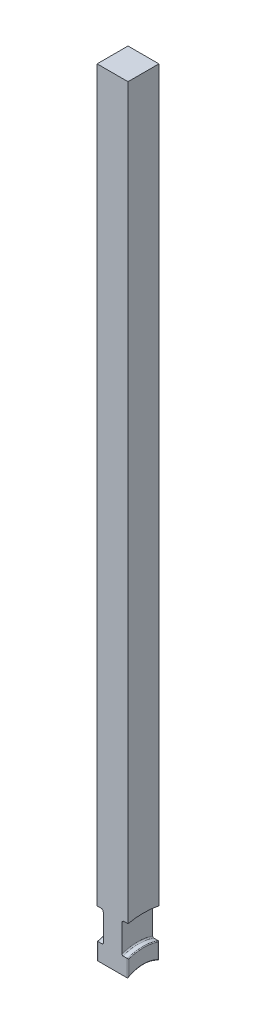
from build123d import *

# Parameters (mm, degrees)
SKETCH1_W               = 10
SKETCH1_H               = 260
BOSS_EXTRUDE1_DEPTH     = 5
CUT_EXTRUDE4_DEPTH      = 261.096136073
CUT_EXTRUDE4_DEPTH_BACK = 261.096136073
SKETCH8_R               = 10
SKETCH2_W               = 2
SKETCH2_H               = 9.5
FILLET1_R               = 0.762
FILLET2_R               = 0.381
FILLET3_R               = 0.25


with BuildPart() as part:
    # Sketch1 → Boss-Extrude1 (new, symmetric)
    with BuildSketch(Plane(origin=(0, 0, 0), x_dir=(0, 0, -1), z_dir=(1, 0, 0))):
        with Locations((0, 130)):
            Rectangle(SKETCH1_W, SKETCH1_H)
    extrude(amount=BOSS_EXTRUDE1_DEPTH, both=True)

    # Sketch8 → Cut-Extrude4 (cut, two sides: drawn at the far end of the back side and taken through both)
    with BuildSketch(Plane(origin=(0, 0, 0), x_dir=(0, 0, -1), z_dir=(1, 0, 0)).offset(-CUT_EXTRUDE4_DEPTH_BACK)):
        Circle(SKETCH8_R)
    extrude(amount=CUT_EXTRUDE4_DEPTH + CUT_EXTRUDE4_DEPTH_BACK, mode=Mode.SUBTRACT)

    # Sketch2 → Cut-Revolve1 (revolve, cut)
    with BuildSketch(Plane.XY):
        with Locations((4, 19.75)):
            Rectangle(SKETCH2_W, SKETCH2_H)
        with Locations((-4, 19.75)):
            Rectangle(SKETCH2_W, SKETCH2_H)
    revolve(axis=Axis((-8.84822894, 0, 0), (1, 0, 0)), mode=Mode.SUBTRACT)

    # Fillet1
    fillet1_edges = [part.edges().sort_by_distance(p)[0] for p in [
        (3, 24.5, 0),
        (-3, 24.5, 0),
    ]]
    fillet(fillet1_edges, radius=FILLET1_R)

    # Fillet2
    fillet2_edges = [part.edges().sort_by_distance(p)[0] for p in [
        (3, 15, 0),
        (-3, 15, 0),
    ]]
    fillet(fillet2_edges, radius=FILLET2_R)

    # Fillet3
    fillet3_edges = [part.edges().sort_by_distance(p)[0] for p in [
        (-5, 11.401194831, -5),
        (5, 11.401194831, -5),
        (5, 10, 0),
        (-5, 10, 0),
        (-5, 11.401194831, 5),
        (5, 11.401194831, 5),
        (5, 15, 0),
        (-5, 15, 0),
    ]]
    fillet(fillet3_edges, radius=FILLET3_R)


solid = part.part
